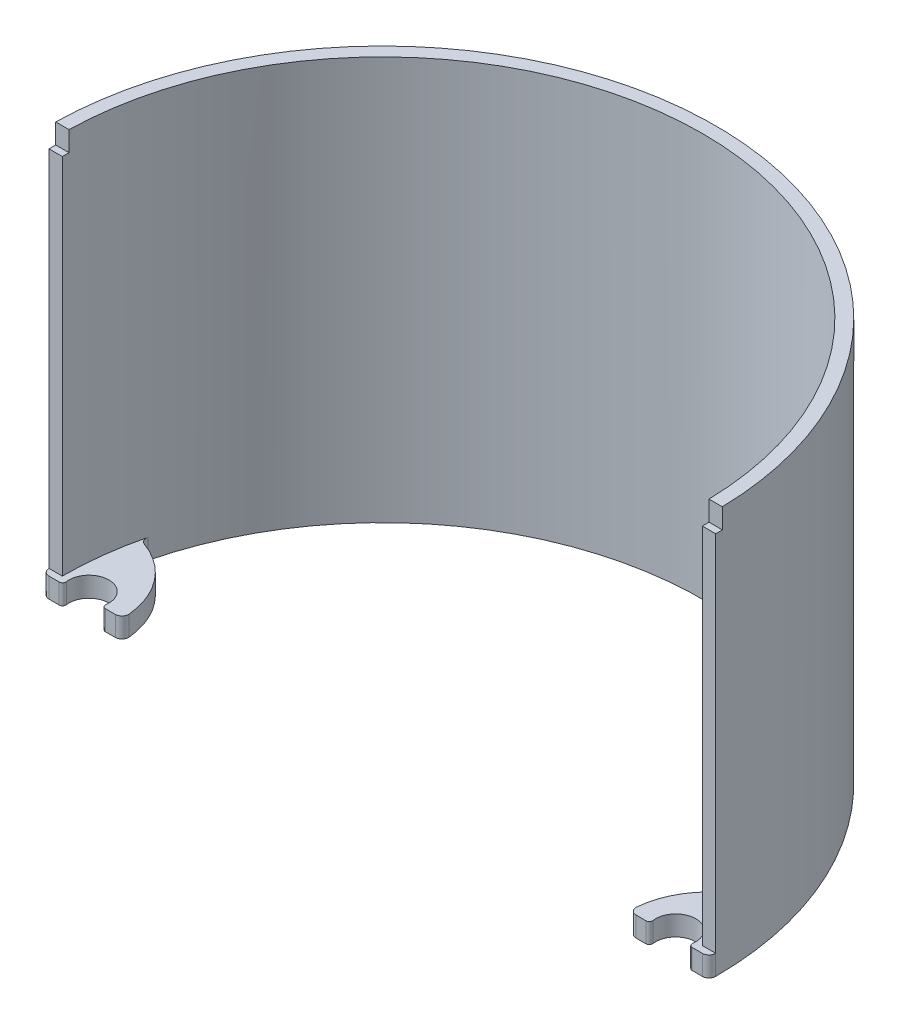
ISO-10303-21;
HEADER;
FILE_DESCRIPTION(('STEP AP214'),'2;1');
FILE_NAME('part.step','',(''),(''),'','','');
FILE_SCHEMA(('AUTOMOTIVE_DESIGN { 1 0 10303 214 1 1 1 1 }'));
ENDSEC;
DATA;
#1=APPLICATION_CONTEXT('core data for automotive mechanical design processes');
#2=APPLICATION_PROTOCOL_DEFINITION('international standard','automotive_design',2000,#1);
#3=PRODUCT_CONTEXT('',#1,'mechanical');
#4=PRODUCT('Part','Part','',(#3));
#5=PRODUCT_RELATED_PRODUCT_CATEGORY('part','',(#4));
#6=PRODUCT_DEFINITION_FORMATION('','',#4);
#7=PRODUCT_DEFINITION_CONTEXT('part definition',#1,'design');
#8=PRODUCT_DEFINITION('design','',#6,#7);
#9=PRODUCT_DEFINITION_SHAPE('','',#8);
#10=(LENGTH_UNIT() NAMED_UNIT(*) SI_UNIT(.MILLI.,.METRE.));
#11=(NAMED_UNIT(*) PLANE_ANGLE_UNIT() SI_UNIT($,.RADIAN.));
#12=(NAMED_UNIT(*) SI_UNIT($,.STERADIAN.) SOLID_ANGLE_UNIT());
#13=UNCERTAINTY_MEASURE_WITH_UNIT(LENGTH_MEASURE(1.E-05),#10,'distance_accuracy_value','');
#14=(GEOMETRIC_REPRESENTATION_CONTEXT(3) GLOBAL_UNCERTAINTY_ASSIGNED_CONTEXT((#13)) GLOBAL_UNIT_ASSIGNED_CONTEXT((#10,
#11,#12)) REPRESENTATION_CONTEXT('',''));
#15=CARTESIAN_POINT('',(0.,0.,0.));
#16=DIRECTION('',(0.,0.,1.));
#17=DIRECTION('',(1.,0.,0.));
#18=AXIS2_PLACEMENT_3D('',#15,#16,#17);
#19=CARTESIAN_POINT('',(48.,60.5,0.));
#20=DIRECTION('',(0.,0.,-1.));
#21=DIRECTION('',(-1.,0.,0.));
#22=AXIS2_PLACEMENT_3D('',#19,#20,#21);
#23=PLANE('',#22);
#24=DIRECTION('',(1.,0.,0.));
#25=VECTOR('',#24,1.);
#26=CARTESIAN_POINT('',(50.,57.5,0.));
#27=LINE('',#26,#25);
#28=CARTESIAN_POINT('',(48.,57.5,0.));
#29=VERTEX_POINT('',#28);
#30=CARTESIAN_POINT('',(50.,57.5,0.));
#31=VERTEX_POINT('',#30);
#32=EDGE_CURVE('E230',#29,#31,#27,.T.);
#33=ORIENTED_EDGE('',*,*,#32,.F.);
#34=DIRECTION('',(0.,-1.,0.));
#35=VECTOR('',#34,1.);
#36=CARTESIAN_POINT('',(48.,60.5,0.));
#37=LINE('',#36,#35);
#38=CARTESIAN_POINT('',(48.,3.,0.));
#39=VERTEX_POINT('',#38);
#40=EDGE_CURVE('E240',#29,#39,#37,.T.);
#41=ORIENTED_EDGE('',*,*,#40,.T.);
#42=DIRECTION('',(-1.,0.,0.));
#43=VECTOR('',#42,1.);
#44=CARTESIAN_POINT('',(48.,3.,0.));
#45=LINE('',#44,#43);
#46=CARTESIAN_POINT('',(50.,3.,0.));
#47=VERTEX_POINT('',#46);
#48=EDGE_CURVE('E399',#47,#39,#45,.T.);
#49=ORIENTED_EDGE('',*,*,#48,.F.);
#50=DIRECTION('',(0.,-1.,0.));
#51=VECTOR('',#50,1.);
#52=CARTESIAN_POINT('',(50.,60.5,0.));
#53=LINE('',#52,#51);
#54=EDGE_CURVE('E238',#31,#47,#53,.T.);
#55=ORIENTED_EDGE('',*,*,#54,.F.);
#56=EDGE_LOOP('',(#33,#41,#49,#55));
#57=FACE_BOUND('',#56,.T.);
#58=ADVANCED_FACE('F33',(#57),#23,.F.);
#59=CARTESIAN_POINT('',(-50.,60.5,0.));
#60=DIRECTION('',(0.,0.,-1.));
#61=DIRECTION('',(-1.,0.,0.));
#62=AXIS2_PLACEMENT_3D('',#59,#60,#61);
#63=PLANE('',#62);
#64=CARTESIAN_POINT('',(-50.,57.5,0.));
#65=VERTEX_POINT('',#64);
#66=CARTESIAN_POINT('',(-48.,57.5,0.));
#67=VERTEX_POINT('',#66);
#68=EDGE_CURVE('E215',#65,#67,#27,.T.);
#69=ORIENTED_EDGE('',*,*,#68,.F.);
#70=DIRECTION('',(0.,-1.,0.));
#71=VECTOR('',#70,1.);
#72=CARTESIAN_POINT('',(-50.,60.5,0.));
#73=LINE('',#72,#71);
#74=CARTESIAN_POINT('',(-50.,3.,0.));
#75=VERTEX_POINT('',#74);
#76=EDGE_CURVE('E226',#65,#75,#73,.T.);
#77=ORIENTED_EDGE('',*,*,#76,.T.);
#78=DIRECTION('',(-1.,0.,0.));
#79=VECTOR('',#78,1.);
#80=CARTESIAN_POINT('',(-50.,3.,0.));
#81=LINE('',#80,#79);
#82=CARTESIAN_POINT('',(-48.,3.,0.));
#83=VERTEX_POINT('',#82);
#84=EDGE_CURVE('E247',#83,#75,#81,.T.);
#85=ORIENTED_EDGE('',*,*,#84,.F.);
#86=DIRECTION('',(0.,-1.,0.));
#87=VECTOR('',#86,1.);
#88=CARTESIAN_POINT('',(-48.,60.5,0.));
#89=LINE('',#88,#87);
#90=EDGE_CURVE('E228',#67,#83,#89,.T.);
#91=ORIENTED_EDGE('',*,*,#90,.F.);
#92=EDGE_LOOP('',(#69,#77,#85,#91));
#93=FACE_BOUND('',#92,.T.);
#94=ADVANCED_FACE('F224',(#93),#63,.F.);
#95=CARTESIAN_POINT('',(0.,60.5,0.));
#96=DIRECTION('',(0.,-1.,0.));
#97=DIRECTION('',(0.,0.,-1.));
#98=AXIS2_PLACEMENT_3D('',#95,#96,#97);
#99=CYLINDRICAL_SURFACE('',#98,48.);
#100=CARTESIAN_POINT('',(0.,60.5,0.));
#101=DIRECTION('',(0.,-1.,0.));
#102=DIRECTION('',(0.,0.,-1.));
#103=AXIS2_PLACEMENT_3D('',#100,#101,#102);
#104=CIRCLE('',#103,48.);
#105=CARTESIAN_POINT('',(-47.9895822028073,60.5,-1.));
#106=VERTEX_POINT('',#105);
#107=CARTESIAN_POINT('',(47.9895822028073,60.5,-1.00000000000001));
#108=VERTEX_POINT('',#107);
#109=EDGE_CURVE('E348',#106,#108,#104,.T.);
#110=ORIENTED_EDGE('',*,*,#109,.F.);
#111=DIRECTION('',(0.,-1.,0.));
#112=VECTOR('',#111,1.);
#113=CARTESIAN_POINT('',(-47.9895822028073,60.5,-1.));
#114=LINE('',#113,#112);
#115=CARTESIAN_POINT('',(-47.9895822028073,57.5,-1.));
#116=VERTEX_POINT('',#115);
#117=EDGE_CURVE('E56',#106,#116,#114,.T.);
#118=ORIENTED_EDGE('',*,*,#117,.T.);
#119=CARTESIAN_POINT('',(0.,57.5,0.));
#120=DIRECTION('',(0.,1.,0.));
#121=DIRECTION('',(0.,0.,1.));
#122=AXIS2_PLACEMENT_3D('',#119,#120,#121);
#123=CIRCLE('',#122,48.);
#124=EDGE_CURVE('E415',#67,#116,#123,.F.);
#125=ORIENTED_EDGE('',*,*,#124,.F.);
#126=ORIENTED_EDGE('',*,*,#90,.T.);
#127=CARTESIAN_POINT('',(0.,3.,0.));
#128=DIRECTION('',(0.,-1.,0.));
#129=DIRECTION('',(0.,0.,-1.));
#130=AXIS2_PLACEMENT_3D('',#127,#128,#129);
#131=CIRCLE('',#130,48.);
#132=CARTESIAN_POINT('',(-46.6099456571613,3.,-11.4679102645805));
#133=VERTEX_POINT('',#132);
#134=EDGE_CURVE('E359',#133,#83,#131,.F.);
#135=ORIENTED_EDGE('',*,*,#134,.F.);
#136=DIRECTION('',(0.,-1.,0.));
#137=VECTOR('',#136,1.);
#138=CARTESIAN_POINT('',(-46.6099456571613,60.5,-11.4679102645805));
#139=LINE('',#138,#137);
#140=CARTESIAN_POINT('',(-46.6099456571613,0.,-11.4679102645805));
#141=VERTEX_POINT('',#140);
#142=EDGE_CURVE('E254',#133,#141,#139,.T.);
#143=ORIENTED_EDGE('',*,*,#142,.T.);
#144=CARTESIAN_POINT('',(0.,0.,0.));
#145=DIRECTION('',(0.,-1.,0.));
#146=DIRECTION('',(0.,0.,-1.));
#147=AXIS2_PLACEMENT_3D('',#144,#145,#146);
#148=CIRCLE('',#147,48.);
#149=CARTESIAN_POINT('',(46.6099456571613,0.,-11.4679102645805));
#150=VERTEX_POINT('',#149);
#151=EDGE_CURVE('E357',#141,#150,#148,.T.);
#152=ORIENTED_EDGE('',*,*,#151,.T.);
#153=DIRECTION('',(0.,-1.,0.));
#154=VECTOR('',#153,1.);
#155=CARTESIAN_POINT('',(46.6099456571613,60.5,-11.4679102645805));
#156=LINE('',#155,#154);
#157=CARTESIAN_POINT('',(46.6099456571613,3.,-11.4679102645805));
#158=VERTEX_POINT('',#157);
#159=EDGE_CURVE('E257',#150,#158,#156,.F.);
#160=ORIENTED_EDGE('',*,*,#159,.T.);
#161=CARTESIAN_POINT('',(0.,3.,0.));
#162=DIRECTION('',(0.,-1.,0.));
#163=DIRECTION('',(0.,0.,-1.));
#164=AXIS2_PLACEMENT_3D('',#161,#162,#163);
#165=CIRCLE('',#164,48.);
#166=EDGE_CURVE('E383',#39,#158,#165,.F.);
#167=ORIENTED_EDGE('',*,*,#166,.F.);
#168=ORIENTED_EDGE('',*,*,#40,.F.);
#169=CARTESIAN_POINT('',(47.9895822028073,57.5,-1.00000000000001));
#170=VERTEX_POINT('',#169);
#171=EDGE_CURVE('E425',#170,#29,#123,.F.);
#172=ORIENTED_EDGE('',*,*,#171,.F.);
#173=DIRECTION('',(0.,-1.,0.));
#174=VECTOR('',#173,1.);
#175=CARTESIAN_POINT('',(47.9895822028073,60.5,-1.00000000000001));
#176=LINE('',#175,#174);
#177=EDGE_CURVE('E353',#170,#108,#176,.F.);
#178=ORIENTED_EDGE('',*,*,#177,.T.);
#179=EDGE_LOOP('',(#110,#118,#125,#126,#135,#143,#152,#160,#167,#168,#172,#178));
#180=FACE_BOUND('',#179,.T.);
#181=ADVANCED_FACE('F351',(#180),#99,.F.);
#182=CARTESIAN_POINT('',(0.,60.5,0.));
#183=DIRECTION('',(0.,-1.,0.));
#184=DIRECTION('',(0.,0.,-1.));
#185=AXIS2_PLACEMENT_3D('',#182,#183,#184);
#186=CYLINDRICAL_SURFACE('',#185,50.);
#187=CARTESIAN_POINT('',(0.,60.5,0.));
#188=DIRECTION('',(0.,1.,0.));
#189=DIRECTION('',(0.,0.,-1.));
#190=AXIS2_PLACEMENT_3D('',#187,#188,#189);
#191=CIRCLE('',#190,50.);
#192=CARTESIAN_POINT('',(49.9899989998,60.5,-1.00000000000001));
#193=VERTEX_POINT('',#192);
#194=CARTESIAN_POINT('',(-49.9899989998,60.5,-1.));
#195=VERTEX_POINT('',#194);
#196=EDGE_CURVE('E242',#193,#195,#191,.T.);
#197=ORIENTED_EDGE('',*,*,#196,.F.);
#198=DIRECTION('',(0.,-1.,0.));
#199=VECTOR('',#198,1.);
#200=CARTESIAN_POINT('',(49.9899989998,60.5,-1.00000000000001));
#201=LINE('',#200,#199);
#202=CARTESIAN_POINT('',(49.9899989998,57.5,-1.00000000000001));
#203=VERTEX_POINT('',#202);
#204=EDGE_CURVE('E48',#193,#203,#201,.T.);
#205=ORIENTED_EDGE('',*,*,#204,.T.);
#206=CARTESIAN_POINT('',(0.,57.5,0.));
#207=DIRECTION('',(0.,1.,0.));
#208=DIRECTION('',(0.,0.,1.));
#209=AXIS2_PLACEMENT_3D('',#206,#207,#208);
#210=CIRCLE('',#209,50.);
#211=EDGE_CURVE('E11',#31,#203,#210,.T.);
#212=ORIENTED_EDGE('',*,*,#211,.F.);
#213=ORIENTED_EDGE('',*,*,#54,.T.);
#214=DIRECTION('',(0.,-1.,0.));
#215=VECTOR('',#214,1.);
#216=CARTESIAN_POINT('',(50.,60.5,0.));
#217=LINE('',#216,#215);
#218=CARTESIAN_POINT('',(50.,0.,0.));
#219=VERTEX_POINT('',#218);
#220=EDGE_CURVE('E278',#47,#219,#217,.T.);
#221=ORIENTED_EDGE('',*,*,#220,.T.);
#222=CARTESIAN_POINT('',(0.,0.,0.));
#223=DIRECTION('',(0.,1.,0.));
#224=DIRECTION('',(0.,0.,-1.));
#225=AXIS2_PLACEMENT_3D('',#222,#223,#224);
#226=CIRCLE('',#225,50.);
#227=CARTESIAN_POINT('',(-50.,0.,0.));
#228=VERTEX_POINT('',#227);
#229=EDGE_CURVE('E354',#219,#228,#226,.T.);
#230=ORIENTED_EDGE('',*,*,#229,.T.);
#231=DIRECTION('',(0.,-1.,0.));
#232=VECTOR('',#231,1.);
#233=CARTESIAN_POINT('',(-50.,60.5,0.));
#234=LINE('',#233,#232);
#235=EDGE_CURVE('E236',#228,#75,#234,.F.);
#236=ORIENTED_EDGE('',*,*,#235,.T.);
#237=ORIENTED_EDGE('',*,*,#76,.F.);
#238=CARTESIAN_POINT('',(-49.9899989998,57.5,-1.));
#239=VERTEX_POINT('',#238);
#240=EDGE_CURVE('E37',#239,#65,#210,.T.);
#241=ORIENTED_EDGE('',*,*,#240,.F.);
#242=DIRECTION('',(0.,-1.,0.));
#243=VECTOR('',#242,1.);
#244=CARTESIAN_POINT('',(-49.9899989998,60.5,-1.));
#245=LINE('',#244,#243);
#246=EDGE_CURVE('E229',#239,#195,#245,.F.);
#247=ORIENTED_EDGE('',*,*,#246,.T.);
#248=EDGE_LOOP('',(#197,#205,#212,#213,#221,#230,#236,#237,#241,#247));
#249=FACE_BOUND('',#248,.T.);
#250=ADVANCED_FACE('F233',(#249),#186,.T.);
#251=CARTESIAN_POINT('',(0.,60.5,0.));
#252=DIRECTION('',(0.,-1.,0.));
#253=DIRECTION('',(0.,0.,-1.));
#254=AXIS2_PLACEMENT_3D('',#251,#252,#253);
#255=PLANE('',#254);
#256=ORIENTED_EDGE('',*,*,#196,.T.);
#257=DIRECTION('',(1.,0.,0.));
#258=VECTOR('',#257,1.);
#259=CARTESIAN_POINT('',(0.,60.5,-1.00000000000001));
#260=LINE('',#259,#258);
#261=EDGE_CURVE('E221',#195,#106,#260,.T.);
#262=ORIENTED_EDGE('',*,*,#261,.T.);
#263=ORIENTED_EDGE('',*,*,#109,.T.);
#264=EDGE_CURVE('E342',#108,#193,#260,.T.);
#265=ORIENTED_EDGE('',*,*,#264,.T.);
#266=EDGE_LOOP('',(#256,#262,#263,#265));
#267=FACE_BOUND('',#266,.T.);
#268=ADVANCED_FACE('F347',(#267),#255,.F.);
#269=CARTESIAN_POINT('',(0.,0.,0.));
#270=DIRECTION('',(0.,-1.,0.));
#271=DIRECTION('',(0.,0.,-1.));
#272=AXIS2_PLACEMENT_3D('',#269,#270,#271);
#273=PLANE('',#272);
#274=CARTESIAN_POINT('',(-44.,0.,0.));
#275=DIRECTION('',(0.,1.,0.));
#276=DIRECTION('',(0.,0.,-1.));
#277=AXIS2_PLACEMENT_3D('',#274,#275,#276);
#278=CIRCLE('',#277,3.);
#279=CARTESIAN_POINT('',(-41.0307700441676,0.,0.42857142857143));
#280=VERTEX_POINT('',#279);
#281=CARTESIAN_POINT('',(-46.9692299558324,0.,0.428571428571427));
#282=VERTEX_POINT('',#281);
#283=EDGE_CURVE('E379',#280,#282,#278,.T.);
#284=ORIENTED_EDGE('',*,*,#283,.T.);
#285=CARTESIAN_POINT('',(-47.4641016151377,0.,0.499999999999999));
#286=DIRECTION('',(0.,-1.,0.));
#287=DIRECTION('',(0.,0.,-1.));
#288=AXIS2_PLACEMENT_3D('',#285,#286,#287);
#289=CIRCLE('',#288,0.5);
#290=CARTESIAN_POINT('',(-47.4641016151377,0.,0.999999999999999));
#291=VERTEX_POINT('',#290);
#292=EDGE_CURVE('E318',#282,#291,#289,.T.);
#293=ORIENTED_EDGE('',*,*,#292,.T.);
#294=DIRECTION('',(-1.,0.,0.));
#295=VECTOR('',#294,1.);
#296=CARTESIAN_POINT('',(-46.8284271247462,0.,0.999999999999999));
#297=LINE('',#296,#295);
#298=CARTESIAN_POINT('',(-49.,0.,0.999999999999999));
#299=VERTEX_POINT('',#298);
#300=EDGE_CURVE('E382',#291,#299,#297,.T.);
#301=ORIENTED_EDGE('',*,*,#300,.T.);
#302=CARTESIAN_POINT('',(-49.,0.,0.));
#303=DIRECTION('',(0.,-1.,0.));
#304=DIRECTION('',(0.,0.,-1.));
#305=AXIS2_PLACEMENT_3D('',#302,#303,#304);
#306=CIRCLE('',#305,1.);
#307=EDGE_CURVE('E263',#299,#228,#306,.T.);
#308=ORIENTED_EDGE('',*,*,#307,.T.);
#309=ORIENTED_EDGE('',*,*,#229,.F.);
#310=CARTESIAN_POINT('',(49.,0.,0.));
#311=DIRECTION('',(0.,-1.,0.));
#312=DIRECTION('',(0.,0.,-1.));
#313=AXIS2_PLACEMENT_3D('',#310,#311,#312);
#314=CIRCLE('',#313,1.);
#315=CARTESIAN_POINT('',(49.,0.,1.00000000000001));
#316=VERTEX_POINT('',#315);
#317=EDGE_CURVE('E267',#219,#316,#314,.T.);
#318=ORIENTED_EDGE('',*,*,#317,.T.);
#319=DIRECTION('',(-1.,0.,0.));
#320=VECTOR('',#319,1.);
#321=CARTESIAN_POINT('',(46.8284271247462,0.,1.00000000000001));
#322=LINE('',#321,#320);
#323=CARTESIAN_POINT('',(47.4641016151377,0.,1.00000000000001));
#324=VERTEX_POINT('',#323);
#325=EDGE_CURVE('E409',#316,#324,#322,.T.);
#326=ORIENTED_EDGE('',*,*,#325,.T.);
#327=CARTESIAN_POINT('',(47.4641016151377,0.,0.500000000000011));
#328=DIRECTION('',(0.,-1.,0.));
#329=DIRECTION('',(0.,0.,-1.));
#330=AXIS2_PLACEMENT_3D('',#327,#328,#329);
#331=CIRCLE('',#330,0.5);
#332=CARTESIAN_POINT('',(46.9692299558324,0.,0.428571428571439));
#333=VERTEX_POINT('',#332);
#334=EDGE_CURVE('E312',#324,#333,#331,.T.);
#335=ORIENTED_EDGE('',*,*,#334,.T.);
#336=CARTESIAN_POINT('',(44.,0.,0.));
#337=DIRECTION('',(0.,1.,0.));
#338=DIRECTION('',(0.,0.,1.));
#339=AXIS2_PLACEMENT_3D('',#336,#337,#338);
#340=CIRCLE('',#339,3.);
#341=CARTESIAN_POINT('',(41.0307700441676,0.,0.428571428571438));
#342=VERTEX_POINT('',#341);
#343=EDGE_CURVE('E406',#333,#342,#340,.T.);
#344=ORIENTED_EDGE('',*,*,#343,.T.);
#345=CARTESIAN_POINT('',(40.5358983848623,0.,0.50000000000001));
#346=DIRECTION('',(0.,-1.,0.));
#347=DIRECTION('',(0.,0.,-1.));
#348=AXIS2_PLACEMENT_3D('',#345,#346,#347);
#349=CIRCLE('',#348,0.5);
#350=CARTESIAN_POINT('',(40.5358983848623,0.,1.00000000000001));
#351=VERTEX_POINT('',#350);
#352=EDGE_CURVE('E314',#342,#351,#349,.T.);
#353=ORIENTED_EDGE('',*,*,#352,.T.);
#354=DIRECTION('',(-1.,0.,0.));
#355=VECTOR('',#354,1.);
#356=CARTESIAN_POINT('',(41.1715728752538,0.,1.00000000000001));
#357=LINE('',#356,#355);
#358=CARTESIAN_POINT('',(39.0556331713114,0.,1.00000000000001));
#359=VERTEX_POINT('',#358);
#360=EDGE_CURVE('E403',#351,#359,#357,.T.);
#361=ORIENTED_EDGE('',*,*,#360,.T.);
#362=CARTESIAN_POINT('',(39.0556331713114,0.,0.));
#363=DIRECTION('',(0.,-1.,0.));
#364=DIRECTION('',(0.,0.,-1.));
#365=AXIS2_PLACEMENT_3D('',#362,#363,#364);
#366=CIRCLE('',#365,1.);
#367=CARTESIAN_POINT('',(38.0597891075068,0.,-0.0910746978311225));
#368=VERTEX_POINT('',#367);
#369=EDGE_CURVE('E269',#359,#368,#366,.T.);
#370=ORIENTED_EDGE('',*,*,#369,.T.);
#371=CARTESIAN_POINT('',(49.9899989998,0.,1.00000000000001));
#372=DIRECTION('',(0.,-1.,0.));
#373=DIRECTION('',(0.,0.,-1.));
#374=AXIS2_PLACEMENT_3D('',#371,#372,#373);
#375=CIRCLE('',#374,11.9799979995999);
#376=CARTESIAN_POINT('',(45.9741204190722,0.,-10.2868539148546));
#377=VERTEX_POINT('',#376);
#378=EDGE_CURVE('E412',#368,#377,#375,.T.);
#379=ORIENTED_EDGE('',*,*,#378,.T.);
#380=CARTESIAN_POINT('',(45.6389051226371,0.,-11.2289954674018));
#381=DIRECTION('',(0.,-1.,0.));
#382=DIRECTION('',(0.,0.,-1.));
#383=AXIS2_PLACEMENT_3D('',#380,#381,#382);
#384=CIRCLE('',#383,1.);
#385=EDGE_CURVE('E298',#377,#150,#384,.F.);
#386=ORIENTED_EDGE('',*,*,#385,.T.);
#387=ORIENTED_EDGE('',*,*,#151,.F.);
#388=CARTESIAN_POINT('',(-45.6389051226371,0.,-11.2289954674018));
#389=DIRECTION('',(0.,-1.,0.));
#390=DIRECTION('',(0.,0.,-1.));
#391=AXIS2_PLACEMENT_3D('',#388,#389,#390);
#392=CIRCLE('',#391,1.);
#393=CARTESIAN_POINT('',(-45.9741204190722,0.,-10.2868539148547));
#394=VERTEX_POINT('',#393);
#395=EDGE_CURVE('E302',#141,#394,#392,.F.);
#396=ORIENTED_EDGE('',*,*,#395,.T.);
#397=CARTESIAN_POINT('',(-49.9899989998,0.,0.999999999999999));
#398=DIRECTION('',(0.,-1.,0.));
#399=DIRECTION('',(0.,0.,1.));
#400=AXIS2_PLACEMENT_3D('',#397,#398,#399);
#401=CIRCLE('',#400,11.9799979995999);
#402=CARTESIAN_POINT('',(-38.0597891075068,0.,-0.0910746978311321));
#403=VERTEX_POINT('',#402);
#404=EDGE_CURVE('E385',#394,#403,#401,.T.);
#405=ORIENTED_EDGE('',*,*,#404,.T.);
#406=CARTESIAN_POINT('',(-39.0556331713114,0.,0.));
#407=DIRECTION('',(0.,-1.,0.));
#408=DIRECTION('',(0.,0.,-1.));
#409=AXIS2_PLACEMENT_3D('',#406,#407,#408);
#410=CIRCLE('',#409,1.);
#411=CARTESIAN_POINT('',(-39.0556331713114,0.,1.));
#412=VERTEX_POINT('',#411);
#413=EDGE_CURVE('E265',#403,#412,#410,.T.);
#414=ORIENTED_EDGE('',*,*,#413,.T.);
#415=DIRECTION('',(-1.,0.,0.));
#416=VECTOR('',#415,1.);
#417=CARTESIAN_POINT('',(-41.1715728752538,0.,1.));
#418=LINE('',#417,#416);
#419=CARTESIAN_POINT('',(-40.5358983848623,0.,1.));
#420=VERTEX_POINT('',#419);
#421=EDGE_CURVE('E387',#412,#420,#418,.T.);
#422=ORIENTED_EDGE('',*,*,#421,.T.);
#423=CARTESIAN_POINT('',(-40.5358983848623,0.,0.5));
#424=DIRECTION('',(0.,-1.,0.));
#425=DIRECTION('',(0.,0.,-1.));
#426=AXIS2_PLACEMENT_3D('',#423,#424,#425);
#427=CIRCLE('',#426,0.5);
#428=EDGE_CURVE('E316',#420,#280,#427,.T.);
#429=ORIENTED_EDGE('',*,*,#428,.T.);
#430=EDGE_LOOP('',(#284,#293,#301,#308,#309,#318,#326,#335,#344,#353,#361,#370,#379,#386,#387,
#396,#405,#414,#422,#429));
#431=FACE_BOUND('',#430,.T.);
#432=ADVANCED_FACE('F449',(#431),#273,.T.);
#433=CARTESIAN_POINT('',(-44.,3.,0.));
#434=DIRECTION('',(0.,-1.,0.));
#435=DIRECTION('',(0.,0.,-1.));
#436=AXIS2_PLACEMENT_3D('',#433,#434,#435);
#437=PLANE('',#436);
#438=DIRECTION('',(-1.,0.,0.));
#439=VECTOR('',#438,1.);
#440=CARTESIAN_POINT('',(-46.8284271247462,3.,0.999999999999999));
#441=LINE('',#440,#439);
#442=CARTESIAN_POINT('',(-47.4641016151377,3.,0.999999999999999));
#443=VERTEX_POINT('',#442);
#444=CARTESIAN_POINT('',(-49.,3.,0.999999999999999));
#445=VERTEX_POINT('',#444);
#446=EDGE_CURVE('E375',#443,#445,#441,.T.);
#447=ORIENTED_EDGE('',*,*,#446,.F.);
#448=CARTESIAN_POINT('',(-47.4641016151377,3.,0.499999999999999));
#449=DIRECTION('',(0.,-1.,0.));
#450=DIRECTION('',(0.,0.,-1.));
#451=AXIS2_PLACEMENT_3D('',#448,#449,#450);
#452=CIRCLE('',#451,0.5);
#453=CARTESIAN_POINT('',(-46.9692299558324,3.,0.428571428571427));
#454=VERTEX_POINT('',#453);
#455=EDGE_CURVE('E324',#443,#454,#452,.F.);
#456=ORIENTED_EDGE('',*,*,#455,.T.);
#457=CARTESIAN_POINT('',(-44.,3.,0.));
#458=DIRECTION('',(0.,1.,0.));
#459=DIRECTION('',(0.,0.,-1.));
#460=AXIS2_PLACEMENT_3D('',#457,#458,#459);
#461=CIRCLE('',#460,3.);
#462=CARTESIAN_POINT('',(-41.0307700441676,3.,0.42857142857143));
#463=VERTEX_POINT('',#462);
#464=EDGE_CURVE('E389',#463,#454,#461,.T.);
#465=ORIENTED_EDGE('',*,*,#464,.F.);
#466=CARTESIAN_POINT('',(-40.5358983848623,3.,0.5));
#467=DIRECTION('',(0.,-1.,0.));
#468=DIRECTION('',(0.,0.,-1.));
#469=AXIS2_PLACEMENT_3D('',#466,#467,#468);
#470=CIRCLE('',#469,0.5);
#471=CARTESIAN_POINT('',(-40.5358983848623,3.,1.));
#472=VERTEX_POINT('',#471);
#473=EDGE_CURVE('E322',#463,#472,#470,.F.);
#474=ORIENTED_EDGE('',*,*,#473,.T.);
#475=DIRECTION('',(-1.,0.,0.));
#476=VECTOR('',#475,1.);
#477=CARTESIAN_POINT('',(-41.1715728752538,3.,1.));
#478=LINE('',#477,#476);
#479=CARTESIAN_POINT('',(-39.0556331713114,3.,1.));
#480=VERTEX_POINT('',#479);
#481=EDGE_CURVE('E366',#480,#472,#478,.T.);
#482=ORIENTED_EDGE('',*,*,#481,.F.);
#483=CARTESIAN_POINT('',(-39.0556331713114,3.,0.));
#484=DIRECTION('',(0.,-1.,0.));
#485=DIRECTION('',(0.,0.,-1.));
#486=AXIS2_PLACEMENT_3D('',#483,#484,#485);
#487=CIRCLE('',#486,1.);
#488=CARTESIAN_POINT('',(-38.0597891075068,3.,-0.0910746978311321));
#489=VERTEX_POINT('',#488);
#490=EDGE_CURVE('E293',#480,#489,#487,.F.);
#491=ORIENTED_EDGE('',*,*,#490,.T.);
#492=CARTESIAN_POINT('',(-49.9899989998,3.,0.999999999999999));
#493=DIRECTION('',(0.,-1.,0.));
#494=DIRECTION('',(0.,0.,1.));
#495=AXIS2_PLACEMENT_3D('',#492,#493,#494);
#496=CIRCLE('',#495,11.9799979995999);
#497=CARTESIAN_POINT('',(-45.9741204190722,3.,-10.2868539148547));
#498=VERTEX_POINT('',#497);
#499=EDGE_CURVE('E369',#498,#489,#496,.T.);
#500=ORIENTED_EDGE('',*,*,#499,.F.);
#501=CARTESIAN_POINT('',(-45.6389051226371,3.,-11.2289954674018));
#502=DIRECTION('',(0.,-1.,0.));
#503=DIRECTION('',(0.,0.,-1.));
#504=AXIS2_PLACEMENT_3D('',#501,#502,#503);
#505=CIRCLE('',#504,1.);
#506=EDGE_CURVE('E304',#498,#133,#505,.T.);
#507=ORIENTED_EDGE('',*,*,#506,.T.);
#508=ORIENTED_EDGE('',*,*,#134,.T.);
#509=ORIENTED_EDGE('',*,*,#84,.T.);
#510=CARTESIAN_POINT('',(-49.,3.,0.));
#511=DIRECTION('',(0.,-1.,0.));
#512=DIRECTION('',(0.,0.,-1.));
#513=AXIS2_PLACEMENT_3D('',#510,#511,#512);
#514=CIRCLE('',#513,1.);
#515=EDGE_CURVE('E290',#75,#445,#514,.F.);
#516=ORIENTED_EDGE('',*,*,#515,.T.);
#517=EDGE_LOOP('',(#447,#456,#465,#474,#482,#491,#500,#507,#508,#509,#516));
#518=FACE_BOUND('',#517,.T.);
#519=ADVANCED_FACE('F462',(#518),#437,.F.);
#520=CARTESIAN_POINT('',(-44.,3.,0.));
#521=DIRECTION('',(0.,-1.,0.));
#522=DIRECTION('',(0.,0.,-1.));
#523=AXIS2_PLACEMENT_3D('',#520,#521,#522);
#524=CYLINDRICAL_SURFACE('',#523,3.);
#525=ORIENTED_EDGE('',*,*,#464,.T.);
#526=DIRECTION('',(0.,-1.,0.));
#527=VECTOR('',#526,1.);
#528=CARTESIAN_POINT('',(-46.9692299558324,3.,0.428571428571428));
#529=LINE('',#528,#527);
#530=EDGE_CURVE('E309',#454,#282,#529,.T.);
#531=ORIENTED_EDGE('',*,*,#530,.T.);
#532=ORIENTED_EDGE('',*,*,#283,.F.);
#533=DIRECTION('',(0.,-1.,0.));
#534=VECTOR('',#533,1.);
#535=CARTESIAN_POINT('',(-41.0307700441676,3.,0.428571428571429));
#536=LINE('',#535,#534);
#537=EDGE_CURVE('E307',#280,#463,#536,.F.);
#538=ORIENTED_EDGE('',*,*,#537,.T.);
#539=EDGE_LOOP('',(#525,#531,#532,#538));
#540=FACE_BOUND('',#539,.T.);
#541=ADVANCED_FACE('F464',(#540),#524,.F.);
#542=CARTESIAN_POINT('',(-41.1715728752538,3.,1.));
#543=DIRECTION('',(0.,0.,1.));
#544=DIRECTION('',(1.,0.,0.));
#545=AXIS2_PLACEMENT_3D('',#542,#543,#544);
#546=PLANE('',#545);
#547=ORIENTED_EDGE('',*,*,#481,.T.);
#548=DIRECTION('',(0.,-1.,0.));
#549=VECTOR('',#548,1.);
#550=CARTESIAN_POINT('',(-40.5358983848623,3.,1.));
#551=LINE('',#550,#549);
#552=EDGE_CURVE('E326',#472,#420,#551,.T.);
#553=ORIENTED_EDGE('',*,*,#552,.T.);
#554=ORIENTED_EDGE('',*,*,#421,.F.);
#555=DIRECTION('',(0.,-1.,0.));
#556=VECTOR('',#555,1.);
#557=CARTESIAN_POINT('',(-39.0556331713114,3.,1.));
#558=LINE('',#557,#556);
#559=EDGE_CURVE('E288',#412,#480,#558,.F.);
#560=ORIENTED_EDGE('',*,*,#559,.T.);
#561=EDGE_LOOP('',(#547,#553,#554,#560));
#562=FACE_BOUND('',#561,.T.);
#563=ADVANCED_FACE('F470',(#562),#546,.T.);
#564=CARTESIAN_POINT('',(-49.9899989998,3.,0.999999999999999));
#565=DIRECTION('',(0.,-1.,0.));
#566=DIRECTION('',(0.,0.,-1.));
#567=AXIS2_PLACEMENT_3D('',#564,#565,#566);
#568=CYLINDRICAL_SURFACE('',#567,11.9799979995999);
#569=ORIENTED_EDGE('',*,*,#404,.F.);
#570=DIRECTION('',(0.,-1.,0.));
#571=VECTOR('',#570,1.);
#572=CARTESIAN_POINT('',(-45.9741204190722,3.,-10.2868539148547));
#573=LINE('',#572,#571);
#574=EDGE_CURVE('E286',#394,#498,#573,.F.);
#575=ORIENTED_EDGE('',*,*,#574,.T.);
#576=ORIENTED_EDGE('',*,*,#499,.T.);
#577=DIRECTION('',(0.,-1.,0.));
#578=VECTOR('',#577,1.);
#579=CARTESIAN_POINT('',(-38.0597891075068,3.,-0.0910746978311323));
#580=LINE('',#579,#578);
#581=EDGE_CURVE('E283',#489,#403,#580,.T.);
#582=ORIENTED_EDGE('',*,*,#581,.T.);
#583=EDGE_LOOP('',(#569,#575,#576,#582));
#584=FACE_BOUND('',#583,.T.);
#585=ADVANCED_FACE('F553',(#584),#568,.T.);
#586=CARTESIAN_POINT('',(-46.8284271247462,3.,0.999999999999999));
#587=DIRECTION('',(0.,0.,1.));
#588=DIRECTION('',(1.,0.,0.));
#589=AXIS2_PLACEMENT_3D('',#586,#587,#588);
#590=PLANE('',#589);
#591=ORIENTED_EDGE('',*,*,#300,.F.);
#592=DIRECTION('',(0.,-1.,0.));
#593=VECTOR('',#592,1.);
#594=CARTESIAN_POINT('',(-47.4641016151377,3.,0.999999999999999));
#595=LINE('',#594,#593);
#596=EDGE_CURVE('E320',#291,#443,#595,.F.);
#597=ORIENTED_EDGE('',*,*,#596,.T.);
#598=ORIENTED_EDGE('',*,*,#446,.T.);
#599=DIRECTION('',(0.,1.,0.));
#600=VECTOR('',#599,1.);
#601=CARTESIAN_POINT('',(-49.,0.,0.999999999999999));
#602=LINE('',#601,#600);
#603=EDGE_CURVE('E295',#445,#299,#602,.F.);
#604=ORIENTED_EDGE('',*,*,#603,.T.);
#605=EDGE_LOOP('',(#591,#597,#598,#604));
#606=FACE_BOUND('',#605,.T.);
#607=ADVANCED_FACE('F458',(#606),#590,.T.);
#608=CARTESIAN_POINT('',(49.9899989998,3.,1.00000000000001));
#609=DIRECTION('',(0.,-1.,0.));
#610=DIRECTION('',(0.,0.,-1.));
#611=AXIS2_PLACEMENT_3D('',#608,#609,#610);
#612=PLANE('',#611);
#613=DIRECTION('',(-1.,0.,0.));
#614=VECTOR('',#613,1.);
#615=CARTESIAN_POINT('',(41.1715728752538,3.,1.00000000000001));
#616=LINE('',#615,#614);
#617=CARTESIAN_POINT('',(40.5358983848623,3.,1.00000000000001));
#618=VERTEX_POINT('',#617);
#619=CARTESIAN_POINT('',(39.0556331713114,3.,1.00000000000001));
#620=VERTEX_POINT('',#619);
#621=EDGE_CURVE('E402',#618,#620,#616,.T.);
#622=ORIENTED_EDGE('',*,*,#621,.F.);
#623=CARTESIAN_POINT('',(40.5358983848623,3.,0.50000000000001));
#624=DIRECTION('',(0.,-1.,0.));
#625=DIRECTION('',(0.,0.,-1.));
#626=AXIS2_PLACEMENT_3D('',#623,#624,#625);
#627=CIRCLE('',#626,0.5);
#628=CARTESIAN_POINT('',(41.0307700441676,3.,0.428571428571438));
#629=VERTEX_POINT('',#628);
#630=EDGE_CURVE('E338',#618,#629,#627,.F.);
#631=ORIENTED_EDGE('',*,*,#630,.T.);
#632=CARTESIAN_POINT('',(44.,3.,0.));
#633=DIRECTION('',(0.,1.,0.));
#634=DIRECTION('',(0.,0.,1.));
#635=AXIS2_PLACEMENT_3D('',#632,#633,#634);
#636=CIRCLE('',#635,3.);
#637=CARTESIAN_POINT('',(46.9692299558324,3.,0.428571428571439));
#638=VERTEX_POINT('',#637);
#639=EDGE_CURVE('E417',#638,#629,#636,.T.);
#640=ORIENTED_EDGE('',*,*,#639,.F.);
#641=CARTESIAN_POINT('',(47.4641016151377,3.,0.500000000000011));
#642=DIRECTION('',(0.,-1.,0.));
#643=DIRECTION('',(0.,0.,-1.));
#644=AXIS2_PLACEMENT_3D('',#641,#642,#643);
#645=CIRCLE('',#644,0.5);
#646=CARTESIAN_POINT('',(47.4641016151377,3.,1.00000000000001));
#647=VERTEX_POINT('',#646);
#648=EDGE_CURVE('E336',#638,#647,#645,.F.);
#649=ORIENTED_EDGE('',*,*,#648,.T.);
#650=DIRECTION('',(-1.,0.,0.));
#651=VECTOR('',#650,1.);
#652=CARTESIAN_POINT('',(46.8284271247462,3.,1.00000000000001));
#653=LINE('',#652,#651);
#654=CARTESIAN_POINT('',(49.,3.,1.00000000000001));
#655=VERTEX_POINT('',#654);
#656=EDGE_CURVE('E420',#655,#647,#653,.T.);
#657=ORIENTED_EDGE('',*,*,#656,.F.);
#658=CARTESIAN_POINT('',(49.,3.,0.));
#659=DIRECTION('',(0.,-1.,0.));
#660=DIRECTION('',(0.,0.,-1.));
#661=AXIS2_PLACEMENT_3D('',#658,#659,#660);
#662=CIRCLE('',#661,1.);
#663=EDGE_CURVE('E271',#655,#47,#662,.F.);
#664=ORIENTED_EDGE('',*,*,#663,.T.);
#665=ORIENTED_EDGE('',*,*,#48,.T.);
#666=ORIENTED_EDGE('',*,*,#166,.T.);
#667=CARTESIAN_POINT('',(45.6389051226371,3.,-11.2289954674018));
#668=DIRECTION('',(0.,-1.,0.));
#669=DIRECTION('',(0.,0.,-1.));
#670=AXIS2_PLACEMENT_3D('',#667,#668,#669);
#671=CIRCLE('',#670,1.);
#672=CARTESIAN_POINT('',(45.9741204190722,3.,-10.2868539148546));
#673=VERTEX_POINT('',#672);
#674=EDGE_CURVE('E300',#158,#673,#671,.T.);
#675=ORIENTED_EDGE('',*,*,#674,.T.);
#676=CARTESIAN_POINT('',(49.9899989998,3.,1.00000000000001));
#677=DIRECTION('',(0.,-1.,0.));
#678=DIRECTION('',(0.,0.,-1.));
#679=AXIS2_PLACEMENT_3D('',#676,#677,#678);
#680=CIRCLE('',#679,11.9799979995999);
#681=CARTESIAN_POINT('',(38.0597891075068,3.,-0.0910746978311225));
#682=VERTEX_POINT('',#681);
#683=EDGE_CURVE('E405',#682,#673,#680,.T.);
#684=ORIENTED_EDGE('',*,*,#683,.F.);
#685=CARTESIAN_POINT('',(39.0556331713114,3.,0.));
#686=DIRECTION('',(0.,-1.,0.));
#687=DIRECTION('',(0.,0.,-1.));
#688=AXIS2_PLACEMENT_3D('',#685,#686,#687);
#689=CIRCLE('',#688,1.);
#690=EDGE_CURVE('E274',#682,#620,#689,.F.);
#691=ORIENTED_EDGE('',*,*,#690,.T.);
#692=EDGE_LOOP('',(#622,#631,#640,#649,#657,#664,#665,#666,#675,#684,#691));
#693=FACE_BOUND('',#692,.T.);
#694=ADVANCED_FACE('F527',(#693),#612,.F.);
#695=CARTESIAN_POINT('',(49.9899989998,3.,1.00000000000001));
#696=DIRECTION('',(0.,-1.,0.));
#697=DIRECTION('',(0.,0.,-1.));
#698=AXIS2_PLACEMENT_3D('',#695,#696,#697);
#699=CYLINDRICAL_SURFACE('',#698,11.9799979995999);
#700=ORIENTED_EDGE('',*,*,#683,.T.);
#701=DIRECTION('',(0.,-1.,0.));
#702=VECTOR('',#701,1.);
#703=CARTESIAN_POINT('',(45.9741204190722,3.,-10.2868539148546));
#704=LINE('',#703,#702);
#705=EDGE_CURVE('E251',#673,#377,#704,.T.);
#706=ORIENTED_EDGE('',*,*,#705,.T.);
#707=ORIENTED_EDGE('',*,*,#378,.F.);
#708=DIRECTION('',(0.,-1.,0.));
#709=VECTOR('',#708,1.);
#710=CARTESIAN_POINT('',(38.0597891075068,3.,-0.0910746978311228));
#711=LINE('',#710,#709);
#712=EDGE_CURVE('E249',#368,#682,#711,.F.);
#713=ORIENTED_EDGE('',*,*,#712,.T.);
#714=EDGE_LOOP('',(#700,#706,#707,#713));
#715=FACE_BOUND('',#714,.T.);
#716=ADVANCED_FACE('F545',(#715),#699,.T.);
#717=CARTESIAN_POINT('',(41.1715728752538,3.,1.00000000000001));
#718=DIRECTION('',(0.,0.,1.));
#719=DIRECTION('',(1.,0.,0.));
#720=AXIS2_PLACEMENT_3D('',#717,#718,#719);
#721=PLANE('',#720);
#722=ORIENTED_EDGE('',*,*,#360,.F.);
#723=DIRECTION('',(0.,-1.,0.));
#724=VECTOR('',#723,1.);
#725=CARTESIAN_POINT('',(40.5358983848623,3.,1.00000000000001));
#726=LINE('',#725,#724);
#727=EDGE_CURVE('E334',#351,#618,#726,.F.);
#728=ORIENTED_EDGE('',*,*,#727,.T.);
#729=ORIENTED_EDGE('',*,*,#621,.T.);
#730=DIRECTION('',(0.,-1.,0.));
#731=VECTOR('',#730,1.);
#732=CARTESIAN_POINT('',(39.0556331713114,3.,1.00000000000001));
#733=LINE('',#732,#731);
#734=EDGE_CURVE('E260',#620,#359,#733,.T.);
#735=ORIENTED_EDGE('',*,*,#734,.T.);
#736=EDGE_LOOP('',(#722,#728,#729,#735));
#737=FACE_BOUND('',#736,.T.);
#738=ADVANCED_FACE('F539',(#737),#721,.T.);
#739=CARTESIAN_POINT('',(44.,3.,0.));
#740=DIRECTION('',(0.,-1.,0.));
#741=DIRECTION('',(0.,0.,-1.));
#742=AXIS2_PLACEMENT_3D('',#739,#740,#741);
#743=CYLINDRICAL_SURFACE('',#742,3.);
#744=ORIENTED_EDGE('',*,*,#639,.T.);
#745=DIRECTION('',(0.,-1.,0.));
#746=VECTOR('',#745,1.);
#747=CARTESIAN_POINT('',(41.0307700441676,3.,0.428571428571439));
#748=LINE('',#747,#746);
#749=EDGE_CURVE('E331',#629,#342,#748,.T.);
#750=ORIENTED_EDGE('',*,*,#749,.T.);
#751=ORIENTED_EDGE('',*,*,#343,.F.);
#752=DIRECTION('',(0.,-1.,0.));
#753=VECTOR('',#752,1.);
#754=CARTESIAN_POINT('',(46.9692299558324,3.,0.428571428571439));
#755=LINE('',#754,#753);
#756=EDGE_CURVE('E329',#333,#638,#755,.F.);
#757=ORIENTED_EDGE('',*,*,#756,.T.);
#758=EDGE_LOOP('',(#744,#750,#751,#757));
#759=FACE_BOUND('',#758,.T.);
#760=ADVANCED_FACE('F530',(#759),#743,.F.);
#761=CARTESIAN_POINT('',(46.8284271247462,3.,1.00000000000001));
#762=DIRECTION('',(0.,0.,1.));
#763=DIRECTION('',(1.,0.,0.));
#764=AXIS2_PLACEMENT_3D('',#761,#762,#763);
#765=PLANE('',#764);
#766=ORIENTED_EDGE('',*,*,#656,.T.);
#767=DIRECTION('',(0.,-1.,0.));
#768=VECTOR('',#767,1.);
#769=CARTESIAN_POINT('',(47.4641016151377,3.,1.00000000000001));
#770=LINE('',#769,#768);
#771=EDGE_CURVE('E340',#647,#324,#770,.T.);
#772=ORIENTED_EDGE('',*,*,#771,.T.);
#773=ORIENTED_EDGE('',*,*,#325,.F.);
#774=DIRECTION('',(0.,1.,0.));
#775=VECTOR('',#774,1.);
#776=CARTESIAN_POINT('',(49.,3.,1.00000000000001));
#777=LINE('',#776,#775);
#778=EDGE_CURVE('E281',#316,#655,#777,.T.);
#779=ORIENTED_EDGE('',*,*,#778,.T.);
#780=EDGE_LOOP('',(#766,#772,#773,#779));
#781=FACE_BOUND('',#780,.T.);
#782=ADVANCED_FACE('F490',(#781),#765,.T.);
#783=CARTESIAN_POINT('',(45.6389051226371,60.5,-11.2289954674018));
#784=DIRECTION('',(0.,-1.,0.));
#785=DIRECTION('',(0.,0.,-1.));
#786=AXIS2_PLACEMENT_3D('',#783,#784,#785);
#787=CYLINDRICAL_SURFACE('',#786,1.);
#788=ORIENTED_EDGE('',*,*,#674,.F.);
#789=ORIENTED_EDGE('',*,*,#159,.F.);
#790=ORIENTED_EDGE('',*,*,#385,.F.);
#791=ORIENTED_EDGE('',*,*,#705,.F.);
#792=EDGE_LOOP('',(#788,#789,#790,#791));
#793=FACE_BOUND('',#792,.T.);
#794=ADVANCED_FACE('F486',(#793),#787,.F.);
#795=CARTESIAN_POINT('',(39.0556331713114,3.,0.));
#796=DIRECTION('',(0.,-1.,0.));
#797=DIRECTION('',(0.,0.,-1.));
#798=AXIS2_PLACEMENT_3D('',#795,#796,#797);
#799=CYLINDRICAL_SURFACE('',#798,1.);
#800=ORIENTED_EDGE('',*,*,#690,.F.);
#801=ORIENTED_EDGE('',*,*,#712,.F.);
#802=ORIENTED_EDGE('',*,*,#369,.F.);
#803=ORIENTED_EDGE('',*,*,#734,.F.);
#804=EDGE_LOOP('',(#800,#801,#802,#803));
#805=FACE_BOUND('',#804,.T.);
#806=ADVANCED_FACE('F489',(#805),#799,.T.);
#807=CARTESIAN_POINT('',(49.,60.5,0.));
#808=DIRECTION('',(0.,-1.,0.));
#809=DIRECTION('',(0.,0.,-1.));
#810=AXIS2_PLACEMENT_3D('',#807,#808,#809);
#811=CYLINDRICAL_SURFACE('',#810,1.);
#812=ORIENTED_EDGE('',*,*,#663,.F.);
#813=ORIENTED_EDGE('',*,*,#778,.F.);
#814=ORIENTED_EDGE('',*,*,#317,.F.);
#815=ORIENTED_EDGE('',*,*,#220,.F.);
#816=EDGE_LOOP('',(#812,#813,#814,#815));
#817=FACE_BOUND('',#816,.T.);
#818=ADVANCED_FACE('F446',(#817),#811,.T.);
#819=CARTESIAN_POINT('',(-45.6389051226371,3.,-11.2289954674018));
#820=DIRECTION('',(0.,-1.,0.));
#821=DIRECTION('',(0.,0.,-1.));
#822=AXIS2_PLACEMENT_3D('',#819,#820,#821);
#823=CYLINDRICAL_SURFACE('',#822,1.);
#824=ORIENTED_EDGE('',*,*,#506,.F.);
#825=ORIENTED_EDGE('',*,*,#574,.F.);
#826=ORIENTED_EDGE('',*,*,#395,.F.);
#827=ORIENTED_EDGE('',*,*,#142,.F.);
#828=EDGE_LOOP('',(#824,#825,#826,#827));
#829=FACE_BOUND('',#828,.T.);
#830=ADVANCED_FACE('F497',(#829),#823,.F.);
#831=CARTESIAN_POINT('',(-39.0556331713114,3.,0.));
#832=DIRECTION('',(0.,-1.,0.));
#833=DIRECTION('',(0.,0.,-1.));
#834=AXIS2_PLACEMENT_3D('',#831,#832,#833);
#835=CYLINDRICAL_SURFACE('',#834,1.);
#836=ORIENTED_EDGE('',*,*,#490,.F.);
#837=ORIENTED_EDGE('',*,*,#559,.F.);
#838=ORIENTED_EDGE('',*,*,#413,.F.);
#839=ORIENTED_EDGE('',*,*,#581,.F.);
#840=EDGE_LOOP('',(#836,#837,#838,#839));
#841=FACE_BOUND('',#840,.T.);
#842=ADVANCED_FACE('F500',(#841),#835,.T.);
#843=CARTESIAN_POINT('',(-49.,60.5,0.));
#844=DIRECTION('',(0.,-1.,0.));
#845=DIRECTION('',(0.,0.,-1.));
#846=AXIS2_PLACEMENT_3D('',#843,#844,#845);
#847=CYLINDRICAL_SURFACE('',#846,1.);
#848=ORIENTED_EDGE('',*,*,#515,.F.);
#849=ORIENTED_EDGE('',*,*,#235,.F.);
#850=ORIENTED_EDGE('',*,*,#307,.F.);
#851=ORIENTED_EDGE('',*,*,#603,.F.);
#852=EDGE_LOOP('',(#848,#849,#850,#851));
#853=FACE_BOUND('',#852,.T.);
#854=ADVANCED_FACE('F456',(#853),#847,.T.);
#855=CARTESIAN_POINT('',(-47.4641016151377,3.,0.499999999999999));
#856=DIRECTION('',(0.,-1.,0.));
#857=DIRECTION('',(0.,0.,-1.));
#858=AXIS2_PLACEMENT_3D('',#855,#856,#857);
#859=CYLINDRICAL_SURFACE('',#858,0.5);
#860=ORIENTED_EDGE('',*,*,#455,.F.);
#861=ORIENTED_EDGE('',*,*,#596,.F.);
#862=ORIENTED_EDGE('',*,*,#292,.F.);
#863=ORIENTED_EDGE('',*,*,#530,.F.);
#864=EDGE_LOOP('',(#860,#861,#862,#863));
#865=FACE_BOUND('',#864,.T.);
#866=ADVANCED_FACE('F507',(#865),#859,.T.);
#867=CARTESIAN_POINT('',(-40.5358983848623,3.,0.5));
#868=DIRECTION('',(0.,-1.,0.));
#869=DIRECTION('',(0.,0.,-1.));
#870=AXIS2_PLACEMENT_3D('',#867,#868,#869);
#871=CYLINDRICAL_SURFACE('',#870,0.5);
#872=ORIENTED_EDGE('',*,*,#473,.F.);
#873=ORIENTED_EDGE('',*,*,#537,.F.);
#874=ORIENTED_EDGE('',*,*,#428,.F.);
#875=ORIENTED_EDGE('',*,*,#552,.F.);
#876=EDGE_LOOP('',(#872,#873,#874,#875));
#877=FACE_BOUND('',#876,.T.);
#878=ADVANCED_FACE('F510',(#877),#871,.T.);
#879=CARTESIAN_POINT('',(40.5358983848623,3.,0.50000000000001));
#880=DIRECTION('',(0.,-1.,0.));
#881=DIRECTION('',(0.,0.,-1.));
#882=AXIS2_PLACEMENT_3D('',#879,#880,#881);
#883=CYLINDRICAL_SURFACE('',#882,0.5);
#884=ORIENTED_EDGE('',*,*,#630,.F.);
#885=ORIENTED_EDGE('',*,*,#727,.F.);
#886=ORIENTED_EDGE('',*,*,#352,.F.);
#887=ORIENTED_EDGE('',*,*,#749,.F.);
#888=EDGE_LOOP('',(#884,#885,#886,#887));
#889=FACE_BOUND('',#888,.T.);
#890=ADVANCED_FACE('F513',(#889),#883,.T.);
#891=CARTESIAN_POINT('',(47.4641016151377,3.,0.500000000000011));
#892=DIRECTION('',(0.,-1.,0.));
#893=DIRECTION('',(0.,0.,-1.));
#894=AXIS2_PLACEMENT_3D('',#891,#892,#893);
#895=CYLINDRICAL_SURFACE('',#894,0.5);
#896=ORIENTED_EDGE('',*,*,#648,.F.);
#897=ORIENTED_EDGE('',*,*,#756,.F.);
#898=ORIENTED_EDGE('',*,*,#334,.F.);
#899=ORIENTED_EDGE('',*,*,#771,.F.);
#900=EDGE_LOOP('',(#896,#897,#898,#899));
#901=FACE_BOUND('',#900,.T.);
#902=ADVANCED_FACE('F35',(#901),#895,.T.);
#903=CARTESIAN_POINT('',(50.,57.5,-1.00000000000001));
#904=DIRECTION('',(0.,0.,-1.));
#905=DIRECTION('',(-1.,0.,0.));
#906=AXIS2_PLACEMENT_3D('',#903,#904,#905);
#907=PLANE('',#906);
#908=DIRECTION('',(-1.,0.,0.));
#909=VECTOR('',#908,1.);
#910=CARTESIAN_POINT('',(50.,57.5,-1.00000000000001));
#911=LINE('',#910,#909);
#912=EDGE_CURVE('E431',#203,#170,#911,.T.);
#913=ORIENTED_EDGE('',*,*,#912,.F.);
#914=ORIENTED_EDGE('',*,*,#204,.F.);
#915=ORIENTED_EDGE('',*,*,#264,.F.);
#916=ORIENTED_EDGE('',*,*,#177,.F.);
#917=EDGE_LOOP('',(#913,#914,#915,#916));
#918=FACE_BOUND('',#917,.T.);
#919=ADVANCED_FACE('F520',(#918),#907,.F.);
#920=CARTESIAN_POINT('',(0.,57.5,0.));
#921=DIRECTION('',(0.,1.,0.));
#922=DIRECTION('',(0.,0.,1.));
#923=AXIS2_PLACEMENT_3D('',#920,#921,#922);
#924=PLANE('',#923);
#925=ORIENTED_EDGE('',*,*,#171,.T.);
#926=ORIENTED_EDGE('',*,*,#32,.T.);
#927=ORIENTED_EDGE('',*,*,#211,.T.);
#928=ORIENTED_EDGE('',*,*,#912,.T.);
#929=EDGE_LOOP('',(#925,#926,#927,#928));
#930=FACE_BOUND('',#929,.T.);
#931=ADVANCED_FACE('F436',(#930),#924,.T.);
#932=ORIENTED_EDGE('',*,*,#124,.T.);
#933=EDGE_CURVE('E217',#116,#239,#911,.T.);
#934=ORIENTED_EDGE('',*,*,#933,.T.);
#935=ORIENTED_EDGE('',*,*,#240,.T.);
#936=ORIENTED_EDGE('',*,*,#68,.T.);
#937=EDGE_LOOP('',(#932,#934,#935,#936));
#938=FACE_BOUND('',#937,.T.);
#939=ADVANCED_FACE('F214',(#938),#924,.T.);
#940=ORIENTED_EDGE('',*,*,#261,.F.);
#941=ORIENTED_EDGE('',*,*,#246,.F.);
#942=ORIENTED_EDGE('',*,*,#933,.F.);
#943=ORIENTED_EDGE('',*,*,#117,.F.);
#944=EDGE_LOOP('',(#940,#941,#942,#943));
#945=FACE_BOUND('',#944,.T.);
#946=ADVANCED_FACE('F675',(#945),#907,.F.);
#947=CLOSED_SHELL('',(#58,#94,#181,#250,#268,#432,#519,#541,#563,#585,#607,#694,#716,#738,#760,
#782,#794,#806,#818,#830,#842,#854,#866,#878,#890,#902,#919,#931,#939,#946));
#948=MANIFOLD_SOLID_BREP('B2',#947);
#949=ADVANCED_BREP_SHAPE_REPRESENTATION('',(#18,#948),#14);
#950=SHAPE_DEFINITION_REPRESENTATION(#9,#949);
ENDSEC;
END-ISO-10303-21;
